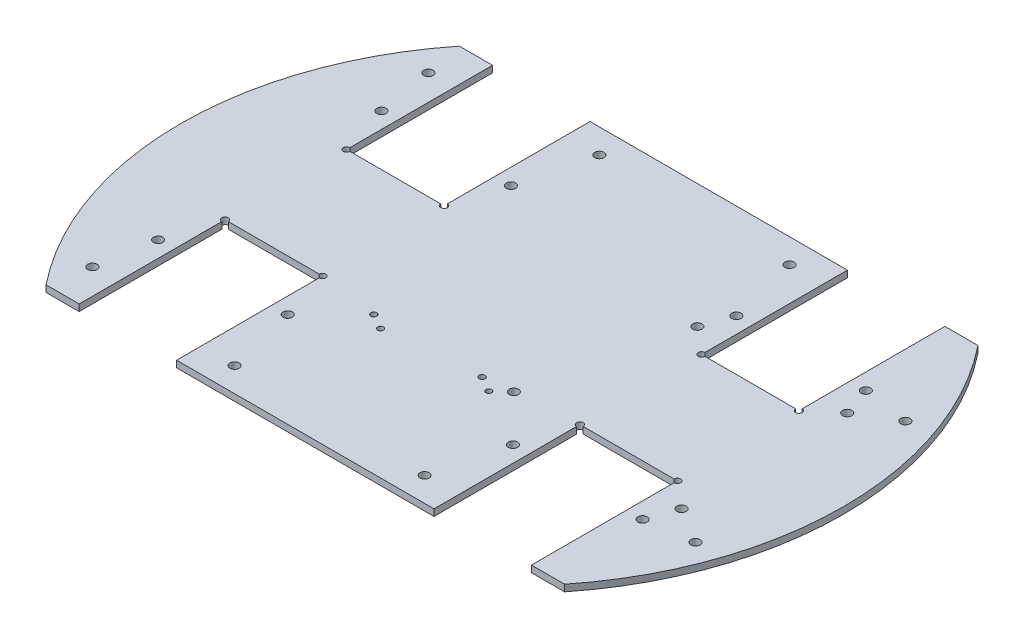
from build123d import *

# Parameters (mm, degrees)
BOSS_EXTRUDE1_DEPTH                        = 3
CUT_EXTRUDE1_REACH                         = 178.78
SKETCH2_R                                  = 2.1
SKETCH2_W                                  = 44.07
SKETCH2_H                                  = 66
MIRROR4_AT_THE_SECOND_PLANE_COPY_1_REACH   = 178.78
MIRROR4_AT_THE_SECOND_PLANE_COPY_1_SKETC_R = 2.1
MIRROR4_AT_THE_SECOND_PLANE_COPY_1_SKETC_W = 44.07
MIRROR4_AT_THE_SECOND_PLANE_COPY_1_SKETC_H = 66
SKETCH3_R                                  = 2.1
CUT_EXTRUDE2_DEPTH                         = 177.780230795
CUT_EXTRUDE5_REACH                         = 178.78
SKETCH6_R                                  = 1.35
SKETCH6_R_2                                = 2.1
SKETCH6_R_3                                = 1.3
CUT_EXTRUDE12_REACH                        = 178.78
SKETCH13_R                                 = 1.5
MIRROR6_AT_THE_SECOND_PLANE_COPY_1_REACH   = 178.78
MIRROR6_AT_THE_SECOND_PLANE_COPY_1_SKETC_R = 1.5


with BuildPart() as part:
    # Sketch1 → Boss-Extrude1 (new body)
    with BuildSketch(Plane(origin=(0, 0, 0), x_dir=(1, 0, 0), z_dir=(0, 1, 0))):
        with BuildLine():
            Line((-117.293435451, 93.5), (117.293435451, 93.5))
            ThreePointArc((117.293435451, 93.5), (150, 0), (117.293435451, -93.5))
            Line((117.293435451, -93.5), (-117.293435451, -93.5))
            ThreePointArc((-117.293435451, -93.5), (-150, 0), (-117.293435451, 93.5))
        make_face()
    extrude(amount=BOSS_EXTRUDE1_DEPTH)

    # Sketch2 → Cut-Extrude1 (cut, up to next)
    with BuildSketch(Plane(origin=(0, 3, 0), x_dir=(1, 0, 0), z_dir=(0, 1, 0)), mode=Mode.PRIVATE) as cut_extrude1_sk1:
        with Locations(Location((-109.548435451, 50.5, 0), (0, 0, 270))):
            Circle(SKETCH2_R)
    cut_extrude1_tool1 = extrude(cut_extrude1_sk1.sketch, amount=-CUT_EXTRUDE1_REACH, mode=Mode.PRIVATE) & part.part
    # Sketch2 → Cut-Extrude1 (cut, up to next)
    with BuildSketch(Plane(origin=(0, 3, 0), x_dir=(1, 0, 0), z_dir=(0, 1, 0)), mode=Mode.PRIVATE) as cut_extrude1_sk2:
        with Locations(Location((-50.968435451, 50.5, 0), (0, 0, 270))):
            Circle(SKETCH2_R)
    cut_extrude1_tool2 = extrude(cut_extrude1_sk2.sketch, amount=-CUT_EXTRUDE1_REACH, mode=Mode.PRIVATE) & part.part
    # Sketch2 → Cut-Extrude1 (cut, up to next)
    with BuildSketch(Plane(origin=(0, 3, 0), x_dir=(1, 0, 0), z_dir=(0, 1, 0)), mode=Mode.PRIVATE) as cut_extrude1_sk3:
        with Locations((-80.258435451, 60.5)):
            Rectangle(SKETCH2_W, SKETCH2_H)
    cut_extrude1_tool3 = extrude(cut_extrude1_sk3.sketch, amount=-CUT_EXTRUDE1_REACH, mode=Mode.PRIVATE) & part.part
    cut_extrude1_1 = cut_extrude1_tool1.solids().sort_by_distance((-109.548435, 3, -50.5))[0]
    add(cut_extrude1_1, mode=Mode.SUBTRACT)
    cut_extrude1_2 = cut_extrude1_tool2.solids().sort_by_distance((-50.968435, 3, -50.5))[0]
    add(cut_extrude1_2, mode=Mode.SUBTRACT)
    cut_extrude1_3 = cut_extrude1_tool3.solids().sort_by_distance((-80.258435, 3, -60.5))[0]
    add(cut_extrude1_3, mode=Mode.SUBTRACT)
    cut_extrude1 = cut_extrude1_1 + cut_extrude1_2 + cut_extrude1_3  # Cut-Extrude1 as one shape, for the pattern or mirror that repeats it

    # Mirror4: Cut-Extrude1 across plane
    add(cut_extrude1.mirror(Plane.XY), mode=Mode.SUBTRACT)

    # Mirror4 at the second plane: Cut-Extrude1 across plane
    add(cut_extrude1.mirror(Plane(origin=(0, 0, 0), x_dir=(0, 0, 1), z_dir=(1, 0, 0))), mode=Mode.SUBTRACT)

    # Mirror4 at the second plane copy 1 sketc → Mirror4 at the second plane copy 1 (cut, up to next)
    with BuildSketch(Plane(origin=(0, 3, 0), x_dir=(-1, 0, 0), z_dir=(0, 1, 0)), mode=Mode.PRIVATE) as mirror4_at_the_second_plane_copy_1_sk1:
        with Locations(Location((-109.548435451, 50.5, 0), (0, 0, 270))):
            Circle(MIRROR4_AT_THE_SECOND_PLANE_COPY_1_SKETC_R)
    mirror4_at_the_second_plane_copy_1_tool1 = extrude(mirror4_at_the_second_plane_copy_1_sk1.sketch, amount=-MIRROR4_AT_THE_SECOND_PLANE_COPY_1_REACH, mode=Mode.PRIVATE) & part.part
    # Mirror4 at the second plane copy 1 sketc → Mirror4 at the second plane copy 1 (cut, up to next)
    with BuildSketch(Plane(origin=(0, 3, 0), x_dir=(-1, 0, 0), z_dir=(0, 1, 0)), mode=Mode.PRIVATE) as mirror4_at_the_second_plane_copy_1_sk2:
        with Locations(Location((-50.968435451, 50.5, 0), (0, 0, 270))):
            Circle(MIRROR4_AT_THE_SECOND_PLANE_COPY_1_SKETC_R)
    mirror4_at_the_second_plane_copy_1_tool2 = extrude(mirror4_at_the_second_plane_copy_1_sk2.sketch, amount=-MIRROR4_AT_THE_SECOND_PLANE_COPY_1_REACH, mode=Mode.PRIVATE) & part.part
    # Mirror4 at the second plane copy 1 sketc → Mirror4 at the second plane copy 1 (cut, up to next)
    with BuildSketch(Plane(origin=(0, 3, 0), x_dir=(-1, 0, 0), z_dir=(0, 1, 0)), mode=Mode.PRIVATE) as mirror4_at_the_second_plane_copy_1_sk3:
        with Locations((-80.258435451, 60.5)):
            Rectangle(MIRROR4_AT_THE_SECOND_PLANE_COPY_1_SKETC_W, MIRROR4_AT_THE_SECOND_PLANE_COPY_1_SKETC_H)
    mirror4_at_the_second_plane_copy_1_tool3 = extrude(mirror4_at_the_second_plane_copy_1_sk3.sketch, amount=-MIRROR4_AT_THE_SECOND_PLANE_COPY_1_REACH, mode=Mode.PRIVATE) & part.part
    add(mirror4_at_the_second_plane_copy_1_tool1.solids().sort_by_distance((109.548435, 3, 50.5))[0], mode=Mode.SUBTRACT)
    add(mirror4_at_the_second_plane_copy_1_tool2.solids().sort_by_distance((50.968435, 3, 50.5))[0], mode=Mode.SUBTRACT)
    add(mirror4_at_the_second_plane_copy_1_tool3.solids().sort_by_distance((80.258435, 3, 60.5))[0], mode=Mode.SUBTRACT)

    # Sketch3 → Cut-Extrude2 (cut, through all)
    with BuildSketch(Plane(origin=(0, 3, 0), x_dir=(1, 0, 0), z_dir=(0, 1, 0))):
        with Locations(Location((-42.993435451, 82.5, 0), (0, 0, 270))):
            Circle(SKETCH3_R)
        with Locations(Location((42.993435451, 82.5, 0), (0, 0, 270))):
            Circle(SKETCH3_R)
        with Locations(Location((-113.813435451, 76, 0), (0, 0, 270))):
            Circle(SKETCH3_R)
        with Locations(Location((130.463435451, 47.48, 0), (0, 0, 270))):
            Circle(SKETCH3_R)
        with Locations(Location((130.463435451, -47.48, 0), (0, 0, 90))):
            Circle(SKETCH3_R)
        with Locations(Location((42.993435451, -82.5, 0), (0, 0, 90))):
            Circle(SKETCH3_R)
        with Locations(Location((-42.993435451, -82.5, 0), (0, 0, 90))):
            Circle(SKETCH3_R)
        with Locations(Location((-113.813435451, -76, 0), (0, 0, 90))):
            Circle(SKETCH3_R)
    extrude(amount=-CUT_EXTRUDE2_DEPTH, mode=Mode.SUBTRACT)

    # Sketch6 → Cut-Extrude5 (cut, up to next)
    with BuildSketch(Plane(origin=(0, 3, 0), x_dir=(1, 0, 0), z_dir=(0, 1, 0)), mode=Mode.PRIVATE) as cut_extrude5_sk1:
        with Locations(Location((-31.526564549, -31, 0), (0, 0, 270))):
            Circle(SKETCH6_R)
    cut_extrude5_tool1 = extrude(cut_extrude5_sk1.sketch, amount=-CUT_EXTRUDE5_REACH, mode=Mode.PRIVATE) & part.part
    # Sketch6 → Cut-Extrude5 (cut, up to next)
    with BuildSketch(Plane(origin=(0, 3, 0), x_dir=(1, 0, 0), z_dir=(0, 1, 0)), mode=Mode.PRIVATE) as cut_extrude5_sk2:
        with Locations(Location((17.473435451, -31, 0), (0, 0, 270))):
            Circle(SKETCH6_R)
    cut_extrude5_tool2 = extrude(cut_extrude5_sk2.sketch, amount=-CUT_EXTRUDE5_REACH, mode=Mode.PRIVATE) & part.part
    # Sketch6 → Cut-Extrude5 (cut, up to next)
    with BuildSketch(Plane(origin=(0, 3, 0), x_dir=(1, 0, 0), z_dir=(0, 1, 0)), mode=Mode.PRIVATE) as cut_extrude5_sk3:
        with Locations(Location((114.153435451, 37.485, 0), (0, 0, 270))):
            Circle(SKETCH6_R_2)
    cut_extrude5_tool3 = extrude(cut_extrude5_sk3.sketch, amount=-CUT_EXTRUDE5_REACH, mode=Mode.PRIVATE) & part.part
    # Sketch6 → Cut-Extrude5 (cut, up to next)
    with BuildSketch(Plane(origin=(0, 3, 0), x_dir=(1, 0, 0), z_dir=(0, 1, 0)), mode=Mode.PRIVATE) as cut_extrude5_sk4:
        with Locations(Location((114.153435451, -37.485, 0), (0, 0, 270))):
            Circle(SKETCH6_R_2)
    cut_extrude5_tool4 = extrude(cut_extrude5_sk4.sketch, amount=-CUT_EXTRUDE5_REACH, mode=Mode.PRIVATE) & part.part
    # Sketch6 → Cut-Extrude5 (cut, up to next)
    with BuildSketch(Plane(origin=(0, 3, 0), x_dir=(1, 0, 0), z_dir=(0, 1, 0)), mode=Mode.PRIVATE) as cut_extrude5_sk5:
        with Locations(Location((46.363435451, 37.485, 0), (0, 0, 270))):
            Circle(SKETCH6_R_2)
    cut_extrude5_tool5 = extrude(cut_extrude5_sk5.sketch, amount=-CUT_EXTRUDE5_REACH, mode=Mode.PRIVATE) & part.part
    # Sketch6 → Cut-Extrude5 (cut, up to next)
    with BuildSketch(Plane(origin=(0, 3, 0), x_dir=(1, 0, 0), z_dir=(0, 1, 0)), mode=Mode.PRIVATE) as cut_extrude5_sk6:
        with Locations(Location((-24.5, -35, 0), (0, 0, 270))):
            Circle(SKETCH6_R_3)
    cut_extrude5_tool6 = extrude(cut_extrude5_sk6.sketch, amount=-CUT_EXTRUDE5_REACH, mode=Mode.PRIVATE) & part.part
    # Sketch6 → Cut-Extrude5 (cut, up to next)
    with BuildSketch(Plane(origin=(0, 3, 0), x_dir=(1, 0, 0), z_dir=(0, 1, 0)), mode=Mode.PRIVATE) as cut_extrude5_sk7:
        with Locations(Location((24.5, -35, 0), (0, 0, 270))):
            Circle(SKETCH6_R_3)
    cut_extrude5_tool7 = extrude(cut_extrude5_sk7.sketch, amount=-CUT_EXTRUDE5_REACH, mode=Mode.PRIVATE) & part.part
    # Sketch6 → Cut-Extrude5 (cut, up to next)
    with BuildSketch(Plane(origin=(0, 3, 0), x_dir=(1, 0, 0), z_dir=(0, 1, 0)), mode=Mode.PRIVATE) as cut_extrude5_sk8:
        with Locations(Location((30.463435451, -29.615, 0), (0, 0, 270))):
            Circle(SKETCH6_R_2)
    cut_extrude5_tool8 = extrude(cut_extrude5_sk8.sketch, amount=-CUT_EXTRUDE5_REACH, mode=Mode.PRIVATE) & part.part
    add(cut_extrude5_tool1.solids().sort_by_distance((-31.526565, 3, 31))[0], mode=Mode.SUBTRACT)
    add(cut_extrude5_tool2.solids().sort_by_distance((17.473435, 3, 31))[0], mode=Mode.SUBTRACT)
    add(cut_extrude5_tool3.solids().sort_by_distance((114.153435, 3, -37.485))[0], mode=Mode.SUBTRACT)
    add(cut_extrude5_tool4.solids().sort_by_distance((114.153435, 3, 37.485))[0], mode=Mode.SUBTRACT)
    add(cut_extrude5_tool5.solids().sort_by_distance((46.363435, 3, -37.485))[0], mode=Mode.SUBTRACT)
    add(cut_extrude5_tool6.solids().sort_by_distance((-24.5, 3, 35))[0], mode=Mode.SUBTRACT)
    add(cut_extrude5_tool7.solids().sort_by_distance((24.5, 3, 35))[0], mode=Mode.SUBTRACT)
    add(cut_extrude5_tool8.solids().sort_by_distance((30.463435, 3, 29.615))[0], mode=Mode.SUBTRACT)

    # Sketch13 → Cut-Extrude12 (cut, up to next)
    with BuildSketch(Plane(origin=(0, 3, 0), x_dir=(1, 0, 0), z_dir=(0, 1, 0)), mode=Mode.PRIVATE) as cut_extrude12_sk1:
        with Locations((-102.293435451, 27.5)):
            Circle(SKETCH13_R)
    cut_extrude12_tool1 = extrude(cut_extrude12_sk1.sketch, amount=-CUT_EXTRUDE12_REACH, mode=Mode.PRIVATE) & part.part
    # Sketch13 → Cut-Extrude12 (cut, up to next)
    with BuildSketch(Plane(origin=(0, 3, 0), x_dir=(1, 0, 0), z_dir=(0, 1, 0)), mode=Mode.PRIVATE) as cut_extrude12_sk2:
        with Locations((-58.223435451, 27.5)):
            Circle(SKETCH13_R)
    cut_extrude12_tool2 = extrude(cut_extrude12_sk2.sketch, amount=-CUT_EXTRUDE12_REACH, mode=Mode.PRIVATE) & part.part
    cut_extrude12_1 = cut_extrude12_tool1.solids().sort_by_distance((-102.293435, 3, -27.5))[0]
    add(cut_extrude12_1, mode=Mode.SUBTRACT)
    cut_extrude12_2 = cut_extrude12_tool2.solids().sort_by_distance((-58.223435, 3, -27.5))[0]
    add(cut_extrude12_2, mode=Mode.SUBTRACT)
    cut_extrude12 = cut_extrude12_1 + cut_extrude12_2  # Cut-Extrude12 as one shape, for the pattern or mirror that repeats it

    # Mirror6: Cut-Extrude12 across plane
    add(cut_extrude12.mirror(Plane(origin=(0, 0, 0), x_dir=(0, 0, 1), z_dir=(1, 0, 0))), mode=Mode.SUBTRACT)

    # Mirror6 at the second plane: Cut-Extrude12 across plane
    add(cut_extrude12.mirror(Plane.XY), mode=Mode.SUBTRACT)

    # Mirror6 at the second plane copy 1 sketc → Mirror6 at the second plane copy 1 (cut, up to next)
    with BuildSketch(Plane(origin=(0, 3, 0), x_dir=(-1, 0, 0), z_dir=(0, 1, 0)), mode=Mode.PRIVATE) as mirror6_at_the_second_plane_copy_1_sk1:
        with Locations((-102.293435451, 27.5)):
            Circle(MIRROR6_AT_THE_SECOND_PLANE_COPY_1_SKETC_R)
    mirror6_at_the_second_plane_copy_1_tool1 = extrude(mirror6_at_the_second_plane_copy_1_sk1.sketch, amount=-MIRROR6_AT_THE_SECOND_PLANE_COPY_1_REACH, mode=Mode.PRIVATE) & part.part
    # Mirror6 at the second plane copy 1 sketc → Mirror6 at the second plane copy 1 (cut, up to next)
    with BuildSketch(Plane(origin=(0, 3, 0), x_dir=(-1, 0, 0), z_dir=(0, 1, 0)), mode=Mode.PRIVATE) as mirror6_at_the_second_plane_copy_1_sk2:
        with Locations((-58.223435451, 27.5)):
            Circle(MIRROR6_AT_THE_SECOND_PLANE_COPY_1_SKETC_R)
    mirror6_at_the_second_plane_copy_1_tool2 = extrude(mirror6_at_the_second_plane_copy_1_sk2.sketch, amount=-MIRROR6_AT_THE_SECOND_PLANE_COPY_1_REACH, mode=Mode.PRIVATE) & part.part
    add(mirror6_at_the_second_plane_copy_1_tool1.solids().sort_by_distance((102.293435, 3, 27.5))[0], mode=Mode.SUBTRACT)
    add(mirror6_at_the_second_plane_copy_1_tool2.solids().sort_by_distance((58.223435, 3, 27.5))[0], mode=Mode.SUBTRACT)


solid = part.part
